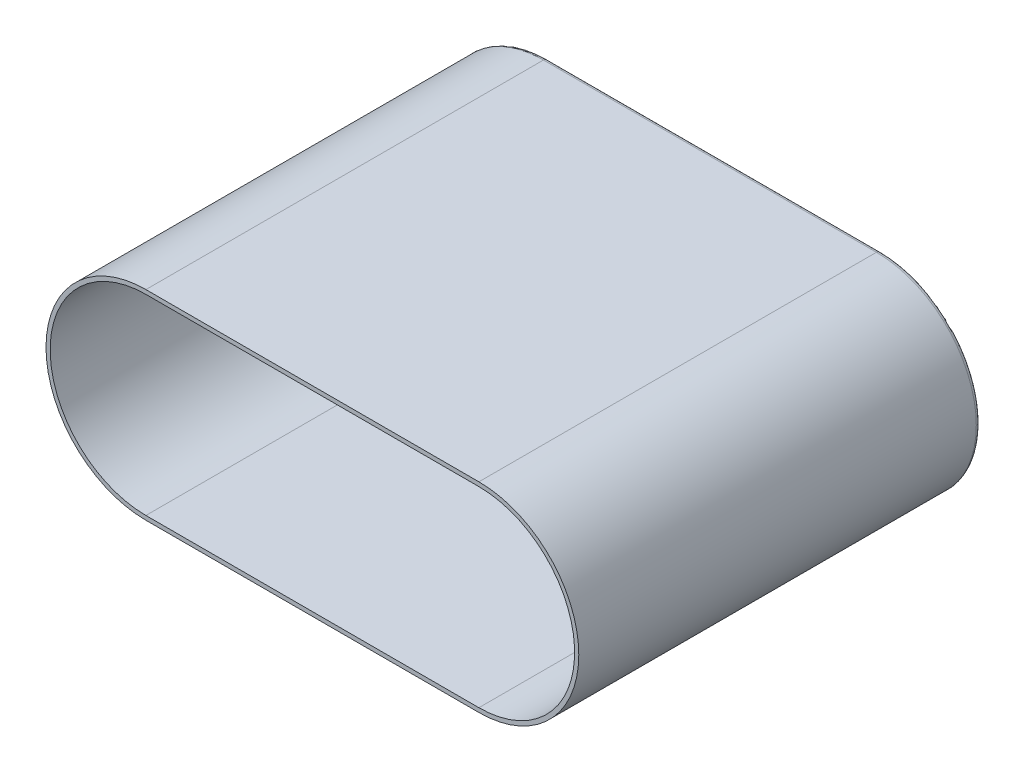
from build123d import *

# Parameters (mm, degrees)
BOSS_EXTRUDE1_DEPTH = 95
BOSS_EXTRUDE2_START = 1.5
BOSS_EXTRUDE2_DEPTH = 1.5
FILLET1_R           = 1


with BuildPart() as part:
    # Sketch1 → Boss-Extrude1 (new body)
    with BuildSketch(Plane.XY):
        with BuildLine():
            Line((-40, 24), (40, 24))
            ThreePointArc((40, 24), (64, 0), (40, -24))
            Line((40, -24), (-40, -24))
            ThreePointArc((-40, -24), (-64, 0), (-40, 24))
        make_face()
        with BuildLine():
            Line((-40, 23), (40, 23))
            ThreePointArc((40, 23), (63, 0), (40, -23))
            Line((40, -23), (-40, -23))
            ThreePointArc((-40, -23), (-63, 0), (-40, 23))
        make_face(mode=Mode.SUBTRACT)
    extrude(amount=BOSS_EXTRUDE1_DEPTH)

    # Sketch2 → Boss-Extrude2 (add)
    with BuildSketch(Plane(origin=(0, 0, 0), x_dir=(-1, 0, 0), z_dir=(0, 0, -1)).offset(BOSS_EXTRUDE2_START)):
        with BuildLine():
            Line((-40, 24), (40, 24))
            ThreePointArc((40, 24), (64, 0), (40, -24))
            Line((40, -24), (-40, -24))
            ThreePointArc((-40, -24), (-64, 0), (-40, 24))
        make_face()
    extrude(amount=-BOSS_EXTRUDE2_DEPTH)

    # Fillet1
    fillet1_edges = [part.edges().sort_by_distance(p)[0] for p in [
        (64, 0, -1.5),
        (0, -24, -1.5),
        (-64, 0, -1.5),
        (0, 24, -1.5),
    ]]
    fillet(fillet1_edges, radius=FILLET1_R)


solid = part.part
